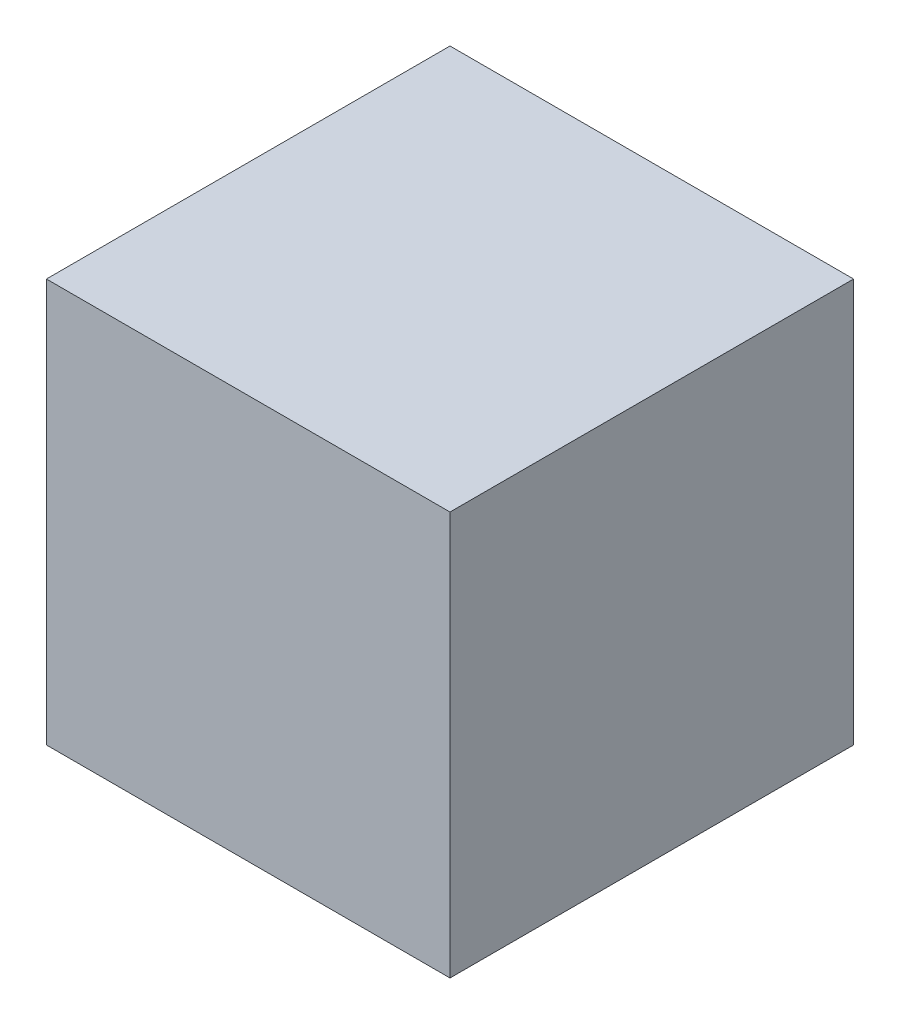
from build123d import *

# Parameters (mm, degrees)
SKETCH1_W           = 40
SKETCH1_H           = 40
BOSS_EXTRUDE1_DEPTH = 40
SKETCH2_R           = 1.59
CUT_EXTRUDE1_DEPTH  = 7


with BuildPart() as part:
    # Sketch1 → Boss-Extrude1 (new body)
    with BuildSketch(Plane.XY):
        Rectangle(SKETCH1_W, SKETCH1_H)
    extrude(amount=BOSS_EXTRUDE1_DEPTH)

    # Sketch2 → Cut-Extrude1 (cut)
    with BuildSketch(Plane(origin=(0, 20, 0), x_dir=(1, 0, 0), z_dir=(0, 0, 1))):
        with Locations(Location((-14.08, -20, 0), (0, 0, 180))):
            Circle(SKETCH2_R)
        with Locations(Location((14.5, -20, 0), (0, 0, 180))):
            Circle(SKETCH2_R)
    extrude(amount=CUT_EXTRUDE1_DEPTH, mode=Mode.SUBTRACT)


solid = part.part
